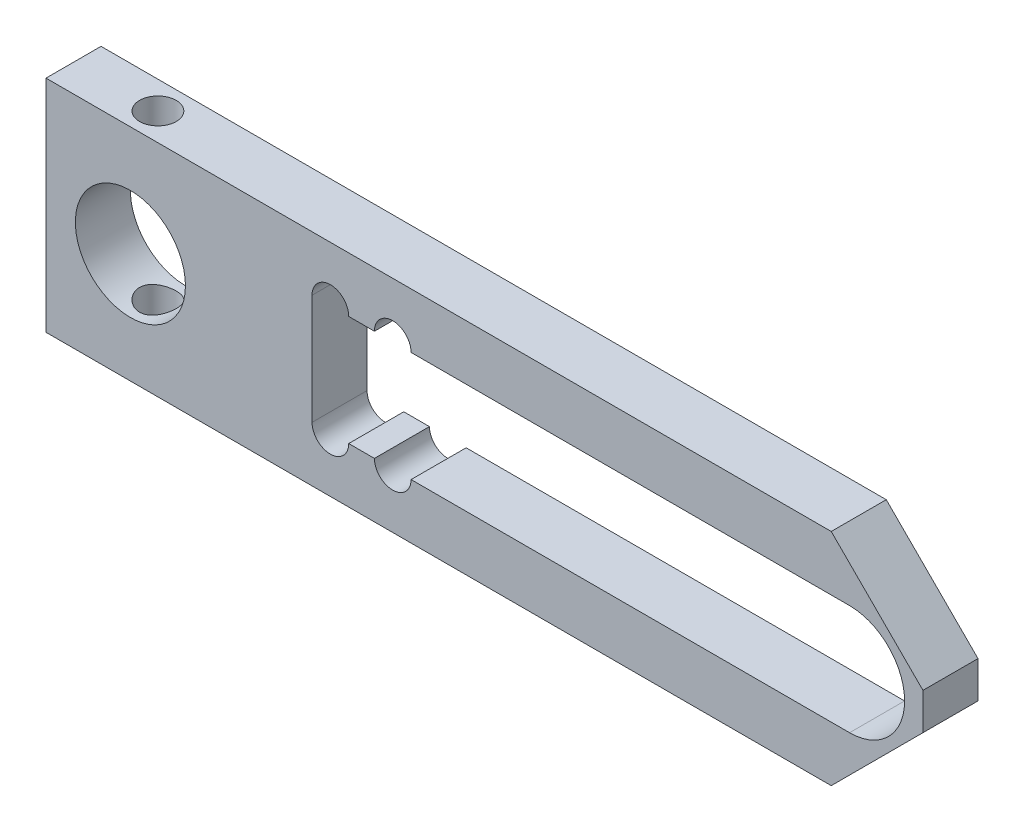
ISO-10303-21;
HEADER;
FILE_DESCRIPTION(('STEP AP214'),'2;1');
FILE_NAME('part.step','',(''),(''),'','','');
FILE_SCHEMA(('AUTOMOTIVE_DESIGN { 1 0 10303 214 1 1 1 1 }'));
ENDSEC;
DATA;
#1=APPLICATION_CONTEXT('core data for automotive mechanical design processes');
#2=APPLICATION_PROTOCOL_DEFINITION('international standard','automotive_design',2000,#1);
#3=PRODUCT_CONTEXT('',#1,'mechanical');
#4=PRODUCT('Part','Part','',(#3));
#5=PRODUCT_RELATED_PRODUCT_CATEGORY('part','',(#4));
#6=PRODUCT_DEFINITION_FORMATION('','',#4);
#7=PRODUCT_DEFINITION_CONTEXT('part definition',#1,'design');
#8=PRODUCT_DEFINITION('design','',#6,#7);
#9=PRODUCT_DEFINITION_SHAPE('','',#8);
#10=(LENGTH_UNIT() NAMED_UNIT(*) SI_UNIT(.MILLI.,.METRE.));
#11=(NAMED_UNIT(*) PLANE_ANGLE_UNIT() SI_UNIT($,.RADIAN.));
#12=(NAMED_UNIT(*) SI_UNIT($,.STERADIAN.) SOLID_ANGLE_UNIT());
#13=UNCERTAINTY_MEASURE_WITH_UNIT(LENGTH_MEASURE(1.E-05),#10,'distance_accuracy_value','');
#14=(GEOMETRIC_REPRESENTATION_CONTEXT(3) GLOBAL_UNCERTAINTY_ASSIGNED_CONTEXT((#13)) GLOBAL_UNIT_ASSIGNED_CONTEXT((#10,
#11,#12)) REPRESENTATION_CONTEXT('',''));
#15=CARTESIAN_POINT('',(0.,0.,0.));
#16=DIRECTION('',(0.,0.,1.));
#17=DIRECTION('',(1.,0.,0.));
#18=AXIS2_PLACEMENT_3D('',#15,#16,#17);
#19=CARTESIAN_POINT('',(71.5,-15.,7.5));
#20=DIRECTION('',(0.,0.,-1.));
#21=DIRECTION('',(-1.,0.,0.));
#22=AXIS2_PLACEMENT_3D('',#19,#20,#21);
#23=CYLINDRICAL_SURFACE('',#22,5.);
#24=CARTESIAN_POINT('',(71.5,-15.,-7.5));
#25=DIRECTION('',(0.,0.,1.));
#26=DIRECTION('',(0.,1.,0.));
#27=AXIS2_PLACEMENT_3D('',#24,#25,#26);
#28=CIRCLE('',#27,5.);
#29=CARTESIAN_POINT('',(66.5,-15.,-7.5));
#30=VERTEX_POINT('',#29);
#31=CARTESIAN_POINT('',(76.5,-15.,-7.5));
#32=VERTEX_POINT('',#31);
#33=EDGE_CURVE('E207',#30,#32,#28,.T.);
#34=ORIENTED_EDGE('',*,*,#33,.F.);
#35=DIRECTION('',(0.,0.,-1.));
#36=VECTOR('',#35,1.);
#37=CARTESIAN_POINT('',(66.5,-15.,7.5));
#38=LINE('',#37,#36);
#39=CARTESIAN_POINT('',(66.5,-15.,7.5));
#40=VERTEX_POINT('',#39);
#41=EDGE_CURVE('E9',#40,#30,#38,.T.);
#42=ORIENTED_EDGE('',*,*,#41,.F.);
#43=CARTESIAN_POINT('',(71.5,-15.,7.5));
#44=DIRECTION('',(0.,0.,1.));
#45=DIRECTION('',(0.,1.,0.));
#46=AXIS2_PLACEMENT_3D('',#43,#44,#45);
#47=CIRCLE('',#46,5.);
#48=CARTESIAN_POINT('',(76.5,-15.,7.5));
#49=VERTEX_POINT('',#48);
#50=EDGE_CURVE('E251',#40,#49,#47,.T.);
#51=ORIENTED_EDGE('',*,*,#50,.T.);
#52=DIRECTION('',(0.,0.,-1.));
#53=VECTOR('',#52,1.);
#54=CARTESIAN_POINT('',(76.5,-15.,7.5));
#55=LINE('',#54,#53);
#56=EDGE_CURVE('E35',#49,#32,#55,.T.);
#57=ORIENTED_EDGE('',*,*,#56,.T.);
#58=EDGE_LOOP('',(#34,#42,#51,#57));
#59=FACE_BOUND('',#58,.T.);
#60=ADVANCED_FACE('F14',(#59),#23,.F.);
#61=CARTESIAN_POINT('',(59.5,-15.,7.5));
#62=DIRECTION('',(0.,1.,0.));
#63=DIRECTION('',(0.,0.,1.));
#64=AXIS2_PLACEMENT_3D('',#61,#62,#63);
#65=PLANE('',#64);
#66=DIRECTION('',(1.,0.,0.));
#67=VECTOR('',#66,1.);
#68=CARTESIAN_POINT('',(59.5,-15.,-7.5));
#69=LINE('',#68,#67);
#70=CARTESIAN_POINT('',(59.5,-15.,-7.5));
#71=VERTEX_POINT('',#70);
#72=EDGE_CURVE('E171',#71,#30,#69,.T.);
#73=ORIENTED_EDGE('',*,*,#72,.F.);
#74=DIRECTION('',(0.,0.,-1.));
#75=VECTOR('',#74,1.);
#76=CARTESIAN_POINT('',(59.5,-15.,7.5));
#77=LINE('',#76,#75);
#78=CARTESIAN_POINT('',(59.5,-15.,7.5));
#79=VERTEX_POINT('',#78);
#80=EDGE_CURVE('E27',#79,#71,#77,.T.);
#81=ORIENTED_EDGE('',*,*,#80,.F.);
#82=DIRECTION('',(1.,0.,0.));
#83=VECTOR('',#82,1.);
#84=CARTESIAN_POINT('',(59.5,-15.,7.5));
#85=LINE('',#84,#83);
#86=EDGE_CURVE('E225',#79,#40,#85,.T.);
#87=ORIENTED_EDGE('',*,*,#86,.T.);
#88=ORIENTED_EDGE('',*,*,#41,.T.);
#89=EDGE_LOOP('',(#73,#81,#87,#88));
#90=FACE_BOUND('',#89,.T.);
#91=ADVANCED_FACE('F310',(#90),#65,.T.);
#92=CARTESIAN_POINT('',(54.5,-15.,7.5));
#93=DIRECTION('',(0.,0.,-1.));
#94=DIRECTION('',(-1.,0.,0.));
#95=AXIS2_PLACEMENT_3D('',#92,#93,#94);
#96=CYLINDRICAL_SURFACE('',#95,5.);
#97=CARTESIAN_POINT('',(54.5,-15.,-7.5));
#98=DIRECTION('',(0.,0.,1.));
#99=DIRECTION('',(-1.,0.,0.));
#100=AXIS2_PLACEMENT_3D('',#97,#98,#99);
#101=CIRCLE('',#100,5.);
#102=CARTESIAN_POINT('',(49.5,-15.,-7.5));
#103=VERTEX_POINT('',#102);
#104=EDGE_CURVE('E175',#103,#71,#101,.T.);
#105=ORIENTED_EDGE('',*,*,#104,.F.);
#106=DIRECTION('',(0.,0.,-1.));
#107=VECTOR('',#106,1.);
#108=CARTESIAN_POINT('',(49.5,-15.,7.5));
#109=LINE('',#108,#107);
#110=CARTESIAN_POINT('',(49.5,-15.,7.5));
#111=VERTEX_POINT('',#110);
#112=EDGE_CURVE('E269',#111,#103,#109,.T.);
#113=ORIENTED_EDGE('',*,*,#112,.F.);
#114=CARTESIAN_POINT('',(54.5,-15.,7.5));
#115=DIRECTION('',(0.,0.,1.));
#116=DIRECTION('',(-1.,0.,0.));
#117=AXIS2_PLACEMENT_3D('',#114,#115,#116);
#118=CIRCLE('',#117,5.);
#119=EDGE_CURVE('E229',#111,#79,#118,.T.);
#120=ORIENTED_EDGE('',*,*,#119,.T.);
#121=ORIENTED_EDGE('',*,*,#80,.T.);
#122=EDGE_LOOP('',(#105,#113,#120,#121));
#123=FACE_BOUND('',#122,.T.);
#124=ADVANCED_FACE('F315',(#123),#96,.F.);
#125=CARTESIAN_POINT('',(49.5,15.,7.5));
#126=DIRECTION('',(1.,0.,0.));
#127=DIRECTION('',(0.,0.,-1.));
#128=AXIS2_PLACEMENT_3D('',#125,#126,#127);
#129=PLANE('',#128);
#130=DIRECTION('',(0.,-1.,0.));
#131=VECTOR('',#130,1.);
#132=CARTESIAN_POINT('',(49.5,15.,-7.5));
#133=LINE('',#132,#131);
#134=CARTESIAN_POINT('',(49.5,15.,-7.5));
#135=VERTEX_POINT('',#134);
#136=EDGE_CURVE('E179',#135,#103,#133,.T.);
#137=ORIENTED_EDGE('',*,*,#136,.F.);
#138=DIRECTION('',(0.,0.,-1.));
#139=VECTOR('',#138,1.);
#140=CARTESIAN_POINT('',(49.5,15.,7.5));
#141=LINE('',#140,#139);
#142=CARTESIAN_POINT('',(49.5,15.,7.5));
#143=VERTEX_POINT('',#142);
#144=EDGE_CURVE('E267',#143,#135,#141,.T.);
#145=ORIENTED_EDGE('',*,*,#144,.F.);
#146=DIRECTION('',(0.,-1.,0.));
#147=VECTOR('',#146,1.);
#148=CARTESIAN_POINT('',(49.5,15.,7.5));
#149=LINE('',#148,#147);
#150=EDGE_CURVE('E232',#143,#111,#149,.T.);
#151=ORIENTED_EDGE('',*,*,#150,.T.);
#152=ORIENTED_EDGE('',*,*,#112,.T.);
#153=EDGE_LOOP('',(#137,#145,#151,#152));
#154=FACE_BOUND('',#153,.T.);
#155=ADVANCED_FACE('F342',(#154),#129,.T.);
#156=CARTESIAN_POINT('',(54.5,15.,7.5));
#157=DIRECTION('',(0.,0.,-1.));
#158=DIRECTION('',(-1.,0.,0.));
#159=AXIS2_PLACEMENT_3D('',#156,#157,#158);
#160=CYLINDRICAL_SURFACE('',#159,5.);
#161=CARTESIAN_POINT('',(54.5,15.,-7.5));
#162=DIRECTION('',(0.,0.,1.));
#163=DIRECTION('',(1.,0.,0.));
#164=AXIS2_PLACEMENT_3D('',#161,#162,#163);
#165=CIRCLE('',#164,5.);
#166=CARTESIAN_POINT('',(59.5,15.,-7.5));
#167=VERTEX_POINT('',#166);
#168=EDGE_CURVE('E183',#167,#135,#165,.T.);
#169=ORIENTED_EDGE('',*,*,#168,.F.);
#170=DIRECTION('',(0.,0.,-1.));
#171=VECTOR('',#170,1.);
#172=CARTESIAN_POINT('',(59.5,15.,7.5));
#173=LINE('',#172,#171);
#174=CARTESIAN_POINT('',(59.5,15.,7.5));
#175=VERTEX_POINT('',#174);
#176=EDGE_CURVE('E265',#175,#167,#173,.T.);
#177=ORIENTED_EDGE('',*,*,#176,.F.);
#178=CARTESIAN_POINT('',(54.5,15.,7.5));
#179=DIRECTION('',(0.,0.,1.));
#180=DIRECTION('',(1.,0.,0.));
#181=AXIS2_PLACEMENT_3D('',#178,#179,#180);
#182=CIRCLE('',#181,5.);
#183=EDGE_CURVE('E235',#175,#143,#182,.T.);
#184=ORIENTED_EDGE('',*,*,#183,.T.);
#185=ORIENTED_EDGE('',*,*,#144,.T.);
#186=EDGE_LOOP('',(#169,#177,#184,#185));
#187=FACE_BOUND('',#186,.T.);
#188=ADVANCED_FACE('F338',(#187),#160,.F.);
#189=CARTESIAN_POINT('',(66.5,15.,7.5));
#190=DIRECTION('',(0.,-1.,0.));
#191=DIRECTION('',(1.,0.,0.));
#192=AXIS2_PLACEMENT_3D('',#189,#190,#191);
#193=PLANE('',#192);
#194=DIRECTION('',(-1.,0.,0.));
#195=VECTOR('',#194,1.);
#196=CARTESIAN_POINT('',(66.5,15.,-7.5));
#197=LINE('',#196,#195);
#198=CARTESIAN_POINT('',(66.5,15.,-7.5));
#199=VERTEX_POINT('',#198);
#200=EDGE_CURVE('E187',#199,#167,#197,.T.);
#201=ORIENTED_EDGE('',*,*,#200,.F.);
#202=DIRECTION('',(0.,0.,-1.));
#203=VECTOR('',#202,1.);
#204=CARTESIAN_POINT('',(66.5,15.,7.5));
#205=LINE('',#204,#203);
#206=CARTESIAN_POINT('',(66.5,15.,7.5));
#207=VERTEX_POINT('',#206);
#208=EDGE_CURVE('E263',#207,#199,#205,.T.);
#209=ORIENTED_EDGE('',*,*,#208,.F.);
#210=DIRECTION('',(-1.,0.,0.));
#211=VECTOR('',#210,1.);
#212=CARTESIAN_POINT('',(66.5,15.,7.5));
#213=LINE('',#212,#211);
#214=EDGE_CURVE('E238',#207,#175,#213,.T.);
#215=ORIENTED_EDGE('',*,*,#214,.T.);
#216=ORIENTED_EDGE('',*,*,#176,.T.);
#217=EDGE_LOOP('',(#201,#209,#215,#216));
#218=FACE_BOUND('',#217,.T.);
#219=ADVANCED_FACE('F334',(#218),#193,.T.);
#220=CARTESIAN_POINT('',(71.5,15.,7.5));
#221=DIRECTION('',(0.,0.,-1.));
#222=DIRECTION('',(-1.,0.,0.));
#223=AXIS2_PLACEMENT_3D('',#220,#221,#222);
#224=CYLINDRICAL_SURFACE('',#223,5.);
#225=CARTESIAN_POINT('',(71.5,15.,-7.5));
#226=DIRECTION('',(0.,0.,1.));
#227=DIRECTION('',(1.,0.,0.));
#228=AXIS2_PLACEMENT_3D('',#225,#226,#227);
#229=CIRCLE('',#228,5.);
#230=CARTESIAN_POINT('',(76.5,15.,-7.5));
#231=VERTEX_POINT('',#230);
#232=EDGE_CURVE('E191',#231,#199,#229,.T.);
#233=ORIENTED_EDGE('',*,*,#232,.F.);
#234=DIRECTION('',(0.,0.,-1.));
#235=VECTOR('',#234,1.);
#236=CARTESIAN_POINT('',(76.5,15.,7.5));
#237=LINE('',#236,#235);
#238=CARTESIAN_POINT('',(76.5,15.,7.5));
#239=VERTEX_POINT('',#238);
#240=EDGE_CURVE('E261',#239,#231,#237,.T.);
#241=ORIENTED_EDGE('',*,*,#240,.F.);
#242=CARTESIAN_POINT('',(71.5,15.,7.5));
#243=DIRECTION('',(0.,0.,1.));
#244=DIRECTION('',(1.,0.,0.));
#245=AXIS2_PLACEMENT_3D('',#242,#243,#244);
#246=CIRCLE('',#245,5.);
#247=EDGE_CURVE('E241',#239,#207,#246,.T.);
#248=ORIENTED_EDGE('',*,*,#247,.T.);
#249=ORIENTED_EDGE('',*,*,#208,.T.);
#250=EDGE_LOOP('',(#233,#241,#248,#249));
#251=FACE_BOUND('',#250,.T.);
#252=ADVANCED_FACE('F330',(#251),#224,.F.);
#253=CARTESIAN_POINT('',(196.,15.,7.5));
#254=DIRECTION('',(0.,-1.,0.));
#255=DIRECTION('',(1.,0.,0.));
#256=AXIS2_PLACEMENT_3D('',#253,#254,#255);
#257=PLANE('',#256);
#258=DIRECTION('',(-1.,0.,0.));
#259=VECTOR('',#258,1.);
#260=CARTESIAN_POINT('',(196.,15.,-7.5));
#261=LINE('',#260,#259);
#262=CARTESIAN_POINT('',(196.,15.,-7.5));
#263=VERTEX_POINT('',#262);
#264=EDGE_CURVE('E195',#263,#231,#261,.T.);
#265=ORIENTED_EDGE('',*,*,#264,.F.);
#266=DIRECTION('',(0.,0.,-1.));
#267=VECTOR('',#266,1.);
#268=CARTESIAN_POINT('',(196.,15.,7.5));
#269=LINE('',#268,#267);
#270=CARTESIAN_POINT('',(196.,15.,7.5));
#271=VERTEX_POINT('',#270);
#272=EDGE_CURVE('E259',#271,#263,#269,.T.);
#273=ORIENTED_EDGE('',*,*,#272,.F.);
#274=DIRECTION('',(-1.,0.,0.));
#275=VECTOR('',#274,1.);
#276=CARTESIAN_POINT('',(196.,15.,7.5));
#277=LINE('',#276,#275);
#278=EDGE_CURVE('E244',#271,#239,#277,.T.);
#279=ORIENTED_EDGE('',*,*,#278,.T.);
#280=ORIENTED_EDGE('',*,*,#240,.T.);
#281=EDGE_LOOP('',(#265,#273,#279,#280));
#282=FACE_BOUND('',#281,.T.);
#283=ADVANCED_FACE('F327',(#282),#257,.T.);
#284=CARTESIAN_POINT('',(196.,0.,7.5));
#285=DIRECTION('',(0.,0.,-1.));
#286=DIRECTION('',(-1.,0.,0.));
#287=AXIS2_PLACEMENT_3D('',#284,#285,#286);
#288=CYLINDRICAL_SURFACE('',#287,15.);
#289=CARTESIAN_POINT('',(196.,0.,-7.5));
#290=DIRECTION('',(0.,0.,1.));
#291=DIRECTION('',(-1.,0.,0.));
#292=AXIS2_PLACEMENT_3D('',#289,#290,#291);
#293=CIRCLE('',#292,15.);
#294=CARTESIAN_POINT('',(196.,-15.,-7.5));
#295=VERTEX_POINT('',#294);
#296=EDGE_CURVE('E199',#295,#263,#293,.T.);
#297=ORIENTED_EDGE('',*,*,#296,.F.);
#298=DIRECTION('',(0.,0.,-1.));
#299=VECTOR('',#298,1.);
#300=CARTESIAN_POINT('',(196.,-15.,7.5));
#301=LINE('',#300,#299);
#302=CARTESIAN_POINT('',(196.,-15.,7.5));
#303=VERTEX_POINT('',#302);
#304=EDGE_CURVE('E43',#303,#295,#301,.T.);
#305=ORIENTED_EDGE('',*,*,#304,.F.);
#306=CARTESIAN_POINT('',(196.,0.,7.5));
#307=DIRECTION('',(0.,0.,1.));
#308=DIRECTION('',(-1.,0.,0.));
#309=AXIS2_PLACEMENT_3D('',#306,#307,#308);
#310=CIRCLE('',#309,15.);
#311=EDGE_CURVE('E247',#303,#271,#310,.T.);
#312=ORIENTED_EDGE('',*,*,#311,.T.);
#313=ORIENTED_EDGE('',*,*,#272,.T.);
#314=EDGE_LOOP('',(#297,#305,#312,#313));
#315=FACE_BOUND('',#314,.T.);
#316=ADVANCED_FACE('F324',(#315),#288,.F.);
#317=CARTESIAN_POINT('',(-23.,30.,7.5));
#318=DIRECTION('',(1.,0.,0.));
#319=DIRECTION('',(0.,1.,0.));
#320=AXIS2_PLACEMENT_3D('',#317,#318,#319);
#321=PLANE('',#320);
#322=DIRECTION('',(0.,-1.,0.));
#323=VECTOR('',#322,1.);
#324=CARTESIAN_POINT('',(-23.,30.,-7.5));
#325=LINE('',#324,#323);
#326=CARTESIAN_POINT('',(-23.,30.,-7.5));
#327=VERTEX_POINT('',#326);
#328=CARTESIAN_POINT('',(-23.,-30.,-7.5));
#329=VERTEX_POINT('',#328);
#330=EDGE_CURVE('E140',#327,#329,#325,.T.);
#331=ORIENTED_EDGE('',*,*,#330,.T.);
#332=DIRECTION('',(0.,0.,-1.));
#333=VECTOR('',#332,1.);
#334=CARTESIAN_POINT('',(-23.,-30.,7.5));
#335=LINE('',#334,#333);
#336=CARTESIAN_POINT('',(-23.,-30.,7.5));
#337=VERTEX_POINT('',#336);
#338=EDGE_CURVE('E149',#337,#329,#335,.T.);
#339=ORIENTED_EDGE('',*,*,#338,.F.);
#340=DIRECTION('',(0.,-1.,0.));
#341=VECTOR('',#340,1.);
#342=CARTESIAN_POINT('',(-23.,30.,7.5));
#343=LINE('',#342,#341);
#344=CARTESIAN_POINT('',(-23.,30.,7.5));
#345=VERTEX_POINT('',#344);
#346=EDGE_CURVE('E215',#345,#337,#343,.T.);
#347=ORIENTED_EDGE('',*,*,#346,.F.);
#348=DIRECTION('',(0.,0.,-1.));
#349=VECTOR('',#348,1.);
#350=CARTESIAN_POINT('',(-23.,30.,7.5));
#351=LINE('',#350,#349);
#352=EDGE_CURVE('E159',#345,#327,#351,.T.);
#353=ORIENTED_EDGE('',*,*,#352,.T.);
#354=EDGE_LOOP('',(#331,#339,#347,#353));
#355=FACE_BOUND('',#354,.T.);
#356=ADVANCED_FACE('F16',(#355),#321,.F.);
#357=CARTESIAN_POINT('',(-23.,-30.,7.5));
#358=DIRECTION('',(0.,1.,0.));
#359=DIRECTION('',(0.,0.,1.));
#360=AXIS2_PLACEMENT_3D('',#357,#358,#359);
#361=PLANE('',#360);
#362=CARTESIAN_POINT('',(0.,-30.,0.));
#363=DIRECTION('',(0.,1.,0.));
#364=DIRECTION('',(0.,0.,-1.));
#365=AXIS2_PLACEMENT_3D('',#362,#363,#364);
#366=CIRCLE('',#365,5.);
#367=CARTESIAN_POINT('',(0.,-30.,-5.));
#368=VERTEX_POINT('',#367);
#369=EDGE_CURVE('E286',#368,#368,#366,.T.);
#370=ORIENTED_EDGE('',*,*,#369,.T.);
#371=EDGE_LOOP('',(#370));
#372=FACE_BOUND('',#371,.T.);
#373=DIRECTION('',(1.,0.,0.));
#374=VECTOR('',#373,1.);
#375=CARTESIAN_POINT('',(-23.,-30.,-7.5));
#376=LINE('',#375,#374);
#377=CARTESIAN_POINT('',(191.,-30.,-7.5));
#378=VERTEX_POINT('',#377);
#379=EDGE_CURVE('E134',#329,#378,#376,.T.);
#380=ORIENTED_EDGE('',*,*,#379,.T.);
#381=DIRECTION('',(0.,0.,-1.));
#382=VECTOR('',#381,1.);
#383=CARTESIAN_POINT('',(191.,-30.,7.5));
#384=LINE('',#383,#382);
#385=CARTESIAN_POINT('',(191.,-30.,7.5));
#386=VERTEX_POINT('',#385);
#387=EDGE_CURVE('E155',#386,#378,#384,.T.);
#388=ORIENTED_EDGE('',*,*,#387,.F.);
#389=DIRECTION('',(1.,0.,0.));
#390=VECTOR('',#389,1.);
#391=CARTESIAN_POINT('',(-23.,-30.,7.5));
#392=LINE('',#391,#390);
#393=EDGE_CURVE('E151',#337,#386,#392,.T.);
#394=ORIENTED_EDGE('',*,*,#393,.F.);
#395=ORIENTED_EDGE('',*,*,#338,.T.);
#396=EDGE_LOOP('',(#380,#388,#394,#395));
#397=FACE_BOUND('',#396,.T.);
#398=ADVANCED_FACE('F150',(#372,#397),#361,.F.);
#399=CARTESIAN_POINT('',(216.,-5.00000000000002,7.5));
#400=DIRECTION('',(-0.707106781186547,0.707106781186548,0.));
#401=DIRECTION('',(-0.707106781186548,-0.707106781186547,0.));
#402=AXIS2_PLACEMENT_3D('',#399,#400,#401);
#403=PLANE('',#402);
#404=DIRECTION('',(0.707106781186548,0.707106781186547,0.));
#405=VECTOR('',#404,1.);
#406=CARTESIAN_POINT('',(216.,-5.00000000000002,-7.5));
#407=LINE('',#406,#405);
#408=CARTESIAN_POINT('',(216.,-5.00000000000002,-7.5));
#409=VERTEX_POINT('',#408);
#410=EDGE_CURVE('E142',#378,#409,#407,.T.);
#411=ORIENTED_EDGE('',*,*,#410,.T.);
#412=DIRECTION('',(0.,0.,-1.));
#413=VECTOR('',#412,1.);
#414=CARTESIAN_POINT('',(216.,-5.00000000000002,7.5));
#415=LINE('',#414,#413);
#416=CARTESIAN_POINT('',(216.,-5.00000000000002,7.5));
#417=VERTEX_POINT('',#416);
#418=EDGE_CURVE('E279',#417,#409,#415,.T.);
#419=ORIENTED_EDGE('',*,*,#418,.F.);
#420=DIRECTION('',(0.707106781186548,0.707106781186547,0.));
#421=VECTOR('',#420,1.);
#422=CARTESIAN_POINT('',(216.,-5.00000000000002,7.5));
#423=LINE('',#422,#421);
#424=EDGE_CURVE('E217',#386,#417,#423,.T.);
#425=ORIENTED_EDGE('',*,*,#424,.F.);
#426=ORIENTED_EDGE('',*,*,#387,.T.);
#427=EDGE_LOOP('',(#411,#419,#425,#426));
#428=FACE_BOUND('',#427,.T.);
#429=ADVANCED_FACE('F359',(#428),#403,.F.);
#430=CARTESIAN_POINT('',(216.,-5.00000000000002,7.5));
#431=DIRECTION('',(-1.,0.,0.));
#432=DIRECTION('',(0.,0.,1.));
#433=AXIS2_PLACEMENT_3D('',#430,#431,#432);
#434=PLANE('',#433);
#435=DIRECTION('',(0.,1.,0.));
#436=VECTOR('',#435,1.);
#437=CARTESIAN_POINT('',(216.,-5.00000000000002,-7.5));
#438=LINE('',#437,#436);
#439=CARTESIAN_POINT('',(216.,5.,-7.5));
#440=VERTEX_POINT('',#439);
#441=EDGE_CURVE('E375',#409,#440,#438,.T.);
#442=ORIENTED_EDGE('',*,*,#441,.T.);
#443=DIRECTION('',(0.,0.,-1.));
#444=VECTOR('',#443,1.);
#445=CARTESIAN_POINT('',(216.,5.,7.5));
#446=LINE('',#445,#444);
#447=CARTESIAN_POINT('',(216.,5.,7.5));
#448=VERTEX_POINT('',#447);
#449=EDGE_CURVE('E276',#448,#440,#446,.T.);
#450=ORIENTED_EDGE('',*,*,#449,.F.);
#451=DIRECTION('',(0.,1.,0.));
#452=VECTOR('',#451,1.);
#453=CARTESIAN_POINT('',(216.,-5.00000000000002,7.5));
#454=LINE('',#453,#452);
#455=EDGE_CURVE('E219',#417,#448,#454,.T.);
#456=ORIENTED_EDGE('',*,*,#455,.F.);
#457=ORIENTED_EDGE('',*,*,#418,.T.);
#458=EDGE_LOOP('',(#442,#450,#456,#457));
#459=FACE_BOUND('',#458,.T.);
#460=ADVANCED_FACE('F355',(#459),#434,.F.);
#461=CARTESIAN_POINT('',(191.,30.,7.5));
#462=DIRECTION('',(-0.707106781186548,-0.707106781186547,0.));
#463=DIRECTION('',(0.707106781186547,-0.707106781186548,0.));
#464=AXIS2_PLACEMENT_3D('',#461,#462,#463);
#465=PLANE('',#464);
#466=DIRECTION('',(-0.707106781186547,0.707106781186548,0.));
#467=VECTOR('',#466,1.);
#468=CARTESIAN_POINT('',(191.,30.,-7.5));
#469=LINE('',#468,#467);
#470=CARTESIAN_POINT('',(191.,30.,-7.5));
#471=VERTEX_POINT('',#470);
#472=EDGE_CURVE('E377',#440,#471,#469,.T.);
#473=ORIENTED_EDGE('',*,*,#472,.T.);
#474=DIRECTION('',(0.,0.,-1.));
#475=VECTOR('',#474,1.);
#476=CARTESIAN_POINT('',(191.,30.,7.5));
#477=LINE('',#476,#475);
#478=CARTESIAN_POINT('',(191.,30.,7.5));
#479=VERTEX_POINT('',#478);
#480=EDGE_CURVE('E273',#479,#471,#477,.T.);
#481=ORIENTED_EDGE('',*,*,#480,.F.);
#482=DIRECTION('',(-0.707106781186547,0.707106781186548,0.));
#483=VECTOR('',#482,1.);
#484=CARTESIAN_POINT('',(191.,30.,7.5));
#485=LINE('',#484,#483);
#486=EDGE_CURVE('E221',#448,#479,#485,.T.);
#487=ORIENTED_EDGE('',*,*,#486,.F.);
#488=ORIENTED_EDGE('',*,*,#449,.T.);
#489=EDGE_LOOP('',(#473,#481,#487,#488));
#490=FACE_BOUND('',#489,.T.);
#491=ADVANCED_FACE('F323',(#490),#465,.F.);
#492=CARTESIAN_POINT('',(76.5,-15.,7.5));
#493=DIRECTION('',(0.,1.,0.));
#494=DIRECTION('',(-1.,0.,0.));
#495=AXIS2_PLACEMENT_3D('',#492,#493,#494);
#496=PLANE('',#495);
#497=DIRECTION('',(1.,0.,0.));
#498=VECTOR('',#497,1.);
#499=CARTESIAN_POINT('',(76.5,-15.,-7.5));
#500=LINE('',#499,#498);
#501=EDGE_CURVE('E203',#32,#295,#500,.T.);
#502=ORIENTED_EDGE('',*,*,#501,.F.);
#503=ORIENTED_EDGE('',*,*,#56,.F.);
#504=DIRECTION('',(1.,0.,0.));
#505=VECTOR('',#504,1.);
#506=CARTESIAN_POINT('',(76.5,-15.,7.5));
#507=LINE('',#506,#505);
#508=EDGE_CURVE('E249',#49,#303,#507,.T.);
#509=ORIENTED_EDGE('',*,*,#508,.T.);
#510=ORIENTED_EDGE('',*,*,#304,.T.);
#511=EDGE_LOOP('',(#502,#503,#509,#510));
#512=FACE_BOUND('',#511,.T.);
#513=ADVANCED_FACE('F320',(#512),#496,.T.);
#514=CARTESIAN_POINT('',(191.,30.,7.5));
#515=DIRECTION('',(0.,-1.,0.));
#516=DIRECTION('',(0.,0.,-1.));
#517=AXIS2_PLACEMENT_3D('',#514,#515,#516);
#518=PLANE('',#517);
#519=CARTESIAN_POINT('',(0.,30.,0.));
#520=DIRECTION('',(0.,-1.,0.));
#521=DIRECTION('',(0.,0.,-1.));
#522=AXIS2_PLACEMENT_3D('',#519,#520,#521);
#523=CIRCLE('',#522,5.);
#524=CARTESIAN_POINT('',(0.,30.,-5.));
#525=VERTEX_POINT('',#524);
#526=EDGE_CURVE('E161',#525,#525,#523,.T.);
#527=ORIENTED_EDGE('',*,*,#526,.T.);
#528=EDGE_LOOP('',(#527));
#529=FACE_BOUND('',#528,.T.);
#530=DIRECTION('',(-1.,0.,0.));
#531=VECTOR('',#530,1.);
#532=CARTESIAN_POINT('',(191.,30.,-7.5));
#533=LINE('',#532,#531);
#534=EDGE_CURVE('E169',#471,#327,#533,.T.);
#535=ORIENTED_EDGE('',*,*,#534,.T.);
#536=ORIENTED_EDGE('',*,*,#352,.F.);
#537=DIRECTION('',(-1.,0.,0.));
#538=VECTOR('',#537,1.);
#539=CARTESIAN_POINT('',(191.,30.,7.5));
#540=LINE('',#539,#538);
#541=EDGE_CURVE('E223',#479,#345,#540,.T.);
#542=ORIENTED_EDGE('',*,*,#541,.F.);
#543=ORIENTED_EDGE('',*,*,#480,.T.);
#544=EDGE_LOOP('',(#535,#536,#542,#543));
#545=FACE_BOUND('',#544,.T.);
#546=ADVANCED_FACE('F306',(#529,#545),#518,.F.);
#547=CARTESIAN_POINT('',(0.,0.,7.5));
#548=DIRECTION('',(0.,0.,-1.));
#549=DIRECTION('',(-1.,0.,0.));
#550=AXIS2_PLACEMENT_3D('',#547,#548,#549);
#551=CYLINDRICAL_SURFACE('',#550,15.);
#552=CARTESIAN_POINT('',(0.,-15.,-5.));
#553=CARTESIAN_POINT('',(0.272816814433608,-15.0000007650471,-5.00000126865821));
#554=CARTESIAN_POINT('',(0.54562597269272,-14.9924884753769,-4.97759866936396));
#555=CARTESIAN_POINT('',(1.08320880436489,-14.9632605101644,-4.88885445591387));
#556=CARTESIAN_POINT('',(1.3479816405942,-14.941543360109,-4.82250828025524));
#557=CARTESIAN_POINT('',(1.86166394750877,-14.8862653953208,-4.64840378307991));
#558=CARTESIAN_POINT('',(2.11059912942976,-14.8527243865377,-4.5407146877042));
#559=CARTESIAN_POINT('',(2.58687468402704,-14.7772222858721,-4.2872941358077));
#560=CARTESIAN_POINT('',(2.81421078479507,-14.7352595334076,-4.1415551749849));
#561=CARTESIAN_POINT('',(3.24870837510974,-14.6457047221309,-3.8108709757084));
#562=CARTESIAN_POINT('',(3.45501850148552,-14.5979778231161,-3.62484382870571));
#563=CARTESIAN_POINT('',(3.83416346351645,-14.5030157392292,-3.22116422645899));
#564=CARTESIAN_POINT('',(4.00699092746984,-14.4557806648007,-3.00350482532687));
#565=CARTESIAN_POINT('',(4.31912471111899,-14.3656666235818,-2.53507442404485));
#566=CARTESIAN_POINT('',(4.45732429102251,-14.3229519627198,-2.28353130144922));
#567=CARTESIAN_POINT('',(4.68909436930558,-14.2487652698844,-1.75911952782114));
#568=CARTESIAN_POINT('',(4.78267848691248,-14.2172898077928,-1.48625741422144));
#569=CARTESIAN_POINT('',(4.91936730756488,-14.1705651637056,-0.936633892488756));
#570=CARTESIAN_POINT('',(4.96406724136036,-14.1548047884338,-0.660313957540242));
#571=CARTESIAN_POINT('',(5.00670561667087,-14.1397828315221,-0.103681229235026));
#572=CARTESIAN_POINT('',(5.00465850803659,-14.1405161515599,0.176630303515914));
#573=CARTESIAN_POINT('',(4.95509951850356,-14.1579507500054,0.719683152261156));
#574=CARTESIAN_POINT('',(4.90966956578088,-14.1739207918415,0.982642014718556));
#575=CARTESIAN_POINT('',(4.77803081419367,-14.2188328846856,1.49696709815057));
#576=CARTESIAN_POINT('',(4.69181713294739,-14.2477764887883,1.74833192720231));
#577=CARTESIAN_POINT('',(4.47969529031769,-14.3158955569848,2.2370637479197));
#578=CARTESIAN_POINT('',(4.35317024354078,-14.3552282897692,2.47414012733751));
#579=CARTESIAN_POINT('',(4.06444553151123,-14.4396279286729,2.92435454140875));
#580=CARTESIAN_POINT('',(3.9022355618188,-14.4846964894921,3.13748563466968));
#581=CARTESIAN_POINT('',(3.53674666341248,-14.5783664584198,3.54545799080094));
#582=CARTESIAN_POINT('',(3.3317657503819,-14.6270294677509,3.73876347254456));
#583=CARTESIAN_POINT('',(2.89169784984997,-14.7203469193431,4.08865633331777));
#584=CARTESIAN_POINT('',(2.65660797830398,-14.765000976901,4.24524019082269));
#585=CARTESIAN_POINT('',(2.15973806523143,-14.8458553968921,4.51848150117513));
#586=CARTESIAN_POINT('',(1.89771638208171,-14.8819675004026,4.6347274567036));
#587=CARTESIAN_POINT('',(1.35634541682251,-14.9410283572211,4.82101586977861));
#588=CARTESIAN_POINT('',(1.07700219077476,-14.9639816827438,4.8910743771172));
#589=CARTESIAN_POINT('',(0.521919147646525,-14.9933813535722,4.98027833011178));
#590=CARTESIAN_POINT('',(0.246547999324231,-15.0005000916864,5.00149904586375));
#591=CARTESIAN_POINT('',(-0.30387534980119,-14.9994451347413,4.99833663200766));
#592=CARTESIAN_POINT('',(-0.578927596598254,-14.9912740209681,4.97396120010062));
#593=CARTESIAN_POINT('',(-1.11259933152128,-14.9610012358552,4.8819404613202));
#594=CARTESIAN_POINT('',(-1.37146403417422,-14.9393099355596,4.81556896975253));
#595=CARTESIAN_POINT('',(-1.87427979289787,-14.8845923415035,4.64303277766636));
#596=CARTESIAN_POINT('',(-2.11822894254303,-14.8515646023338,4.53686300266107));
#597=CARTESIAN_POINT('',(-2.59144148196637,-14.7764465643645,4.28464784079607));
#598=CARTESIAN_POINT('',(-2.82014979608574,-14.7341407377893,4.13762703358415));
#599=CARTESIAN_POINT('',(-3.25032415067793,-14.6452626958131,3.80902924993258));
#600=CARTESIAN_POINT('',(-3.45178183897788,-14.5986891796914,3.62744171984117));
#601=CARTESIAN_POINT('',(-3.8312625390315,-14.5038423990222,3.22510624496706));
#602=CARTESIAN_POINT('',(-4.00780484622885,-14.4555880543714,3.0029538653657));
#603=CARTESIAN_POINT('',(-4.32128761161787,-14.3649986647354,2.53114216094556));
#604=CARTESIAN_POINT('',(-4.45822773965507,-14.3226636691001,2.28148260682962));
#605=CARTESIAN_POINT('',(-4.68798465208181,-14.2491195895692,1.76163492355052));
#606=CARTESIAN_POINT('',(-4.7808906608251,-14.2178880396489,1.49148960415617));
#607=CARTESIAN_POINT('',(-4.91947333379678,-14.1705416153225,0.938106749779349));
#608=CARTESIAN_POINT('',(-4.9651712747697,-14.154419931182,0.654875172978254));
#609=CARTESIAN_POINT('',(-5.00638141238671,-14.1398929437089,0.0990145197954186));
#610=CARTESIAN_POINT('',(-5.004351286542,-14.1406200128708,-0.173411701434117));
#611=CARTESIAN_POINT('',(-4.95621146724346,-14.1575634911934,-0.713825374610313));
#612=CARTESIAN_POINT('',(-4.91010439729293,-14.1737789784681,-0.981813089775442));
#613=CARTESIAN_POINT('',(-4.77685906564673,-14.2192262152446,-1.50067831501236));
#614=CARTESIAN_POINT('',(-4.69051673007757,-14.2482049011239,-1.75178412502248));
#615=CARTESIAN_POINT('',(-4.47989682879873,-14.3158199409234,-2.23613703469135));
#616=CARTESIAN_POINT('',(-4.35561084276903,-14.3544584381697,-2.46938015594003));
#617=CARTESIAN_POINT('',(-4.06630346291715,-14.4391414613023,-2.92241834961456));
#618=CARTESIAN_POINT('',(-3.8997412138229,-14.4854355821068,-3.14118250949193));
#619=CARTESIAN_POINT('',(-3.53321441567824,-14.5791678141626,-3.548449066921));
#620=CARTESIAN_POINT('',(-3.33324042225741,-14.6266062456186,-3.73694287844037));
#621=CARTESIAN_POINT('',(-2.89620778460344,-14.7195015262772,-4.08572206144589));
#622=CARTESIAN_POINT('',(-2.65800756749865,-14.7648090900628,-4.244621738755));
#623=CARTESIAN_POINT('',(-2.15678678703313,-14.8462995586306,-4.51995214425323));
#624=CARTESIAN_POINT('',(-1.89377259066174,-14.8824847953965,-4.63639372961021));
#625=CARTESIAN_POINT('',(-1.36246823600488,-14.9402757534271,-4.81860816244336));
#626=CARTESIAN_POINT('',(-1.09493878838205,-14.9624606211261,-4.88641233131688));
#627=CARTESIAN_POINT('',(-0.551602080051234,-14.9923203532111,-4.97710140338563));
#628=CARTESIAN_POINT('',(-0.275797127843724,-14.9999992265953,-4.99999871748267));
#629=CARTESIAN_POINT('',(0.,-15.,-5.));
#630=B_SPLINE_CURVE_WITH_KNOTS('',3,(#552,#553,#554,#555,#556,#557,#558,#559,#560,#561,#562,
#563,#564,#565,#566,#567,#568,#569,#570,#571,#572,#573,#574,#575,#576,#577,#578,#579,#580,#581,
#582,#583,#584,#585,#586,#587,#588,#589,#590,#591,#592,#593,#594,#595,#596,#597,#598,#599,#600,
#601,#602,#603,#604,#605,#606,#607,#608,#609,#610,#611,#612,#613,#614,#615,#616,#617,#618,#619,
#620,#621,#622,#623,#624,#625,#626,#627,#628,#629),.UNSPECIFIED.,.T.,.F.,(4,2,2,2,2,2,2,2,2,2,2,
2,2,2,2,2,2,2,2,2,2,2,2,2,2,2,2,2,2,2,2,2,2,2,2,2,2,2,4),(0.,0.817435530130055,1.6349559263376,
2.45111336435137,3.2674318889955,4.1092342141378,4.95122166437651,5.81741924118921,
6.6833522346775,7.52009628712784,8.3565816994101,9.15484132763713,9.95319654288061,
10.764408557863,11.5758551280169,12.4296652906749,13.2835572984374,14.1459202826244,
15.0079834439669,15.832679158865,16.6572356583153,17.4579078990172,18.2586822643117,
19.0805199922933,19.9026090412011,20.7620511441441,21.6215004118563,22.479200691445,
23.3365142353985,24.1497833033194,24.9630039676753,25.7607793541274,26.5587319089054,
27.3915033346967,28.2245105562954,29.0899830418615,29.9552340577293,30.7818279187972,
31.6081933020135),.UNSPECIFIED.);
#631=CARTESIAN_POINT('',(0.,-15.,-5.));
#632=VERTEX_POINT('',#631);
#633=EDGE_CURVE('E18',#632,#632,#630,.T.);
#634=ORIENTED_EDGE('',*,*,#633,.T.);
#635=EDGE_LOOP('',(#634));
#636=FACE_BOUND('',#635,.T.);
#637=CARTESIAN_POINT('',(0.,15.,-5.));
#638=CARTESIAN_POINT('',(-0.272816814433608,15.0000007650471,-5.00000126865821));
#639=CARTESIAN_POINT('',(-0.54562597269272,14.9924884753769,-4.97759866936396));
#640=CARTESIAN_POINT('',(-1.08320880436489,14.9632605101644,-4.88885445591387));
#641=CARTESIAN_POINT('',(-1.3479816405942,14.941543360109,-4.82250828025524));
#642=CARTESIAN_POINT('',(-1.86166394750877,14.8862653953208,-4.64840378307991));
#643=CARTESIAN_POINT('',(-2.11059912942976,14.8527243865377,-4.5407146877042));
#644=CARTESIAN_POINT('',(-2.58687468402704,14.7772222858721,-4.2872941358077));
#645=CARTESIAN_POINT('',(-2.81421078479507,14.7352595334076,-4.1415551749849));
#646=CARTESIAN_POINT('',(-3.24870837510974,14.6457047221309,-3.8108709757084));
#647=CARTESIAN_POINT('',(-3.45501850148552,14.5979778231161,-3.62484382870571));
#648=CARTESIAN_POINT('',(-3.83416346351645,14.5030157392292,-3.22116422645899));
#649=CARTESIAN_POINT('',(-4.00699092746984,14.4557806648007,-3.00350482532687));
#650=CARTESIAN_POINT('',(-4.31912471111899,14.3656666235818,-2.53507442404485));
#651=CARTESIAN_POINT('',(-4.45732429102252,14.3229519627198,-2.28353130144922));
#652=CARTESIAN_POINT('',(-4.68909436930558,14.2487652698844,-1.75911952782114));
#653=CARTESIAN_POINT('',(-4.78267848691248,14.2172898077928,-1.48625741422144));
#654=CARTESIAN_POINT('',(-4.91936730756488,14.1705651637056,-0.936633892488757));
#655=CARTESIAN_POINT('',(-4.96406724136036,14.1548047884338,-0.660313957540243));
#656=CARTESIAN_POINT('',(-5.00670561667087,14.1397828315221,-0.103681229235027));
#657=CARTESIAN_POINT('',(-5.00465850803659,14.1405161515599,0.176630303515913));
#658=CARTESIAN_POINT('',(-4.95509951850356,14.1579507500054,0.719683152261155));
#659=CARTESIAN_POINT('',(-4.90966956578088,14.1739207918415,0.982642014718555));
#660=CARTESIAN_POINT('',(-4.77803081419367,14.2188328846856,1.49696709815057));
#661=CARTESIAN_POINT('',(-4.69181713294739,14.2477764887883,1.74833192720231));
#662=CARTESIAN_POINT('',(-4.47969529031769,14.3158955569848,2.23706374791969));
#663=CARTESIAN_POINT('',(-4.35317024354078,14.3552282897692,2.47414012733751));
#664=CARTESIAN_POINT('',(-4.06444553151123,14.4396279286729,2.92435454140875));
#665=CARTESIAN_POINT('',(-3.9022355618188,14.4846964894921,3.13748563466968));
#666=CARTESIAN_POINT('',(-3.53674666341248,14.5783664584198,3.54545799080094));
#667=CARTESIAN_POINT('',(-3.3317657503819,14.6270294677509,3.73876347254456));
#668=CARTESIAN_POINT('',(-2.89169784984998,14.7203469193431,4.08865633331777));
#669=CARTESIAN_POINT('',(-2.65660797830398,14.765000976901,4.24524019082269));
#670=CARTESIAN_POINT('',(-2.15973806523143,14.8458553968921,4.51848150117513));
#671=CARTESIAN_POINT('',(-1.89771638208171,14.8819675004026,4.6347274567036));
#672=CARTESIAN_POINT('',(-1.35634541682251,14.9410283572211,4.82101586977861));
#673=CARTESIAN_POINT('',(-1.07700219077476,14.9639816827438,4.8910743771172));
#674=CARTESIAN_POINT('',(-0.521919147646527,14.9933813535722,4.98027833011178));
#675=CARTESIAN_POINT('',(-0.246547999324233,15.0005000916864,5.00149904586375));
#676=CARTESIAN_POINT('',(0.303875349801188,14.9994451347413,4.99833663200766));
#677=CARTESIAN_POINT('',(0.578927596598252,14.9912740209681,4.97396120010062));
#678=CARTESIAN_POINT('',(1.11259933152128,14.9610012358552,4.88194046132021));
#679=CARTESIAN_POINT('',(1.37146403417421,14.9393099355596,4.81556896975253));
#680=CARTESIAN_POINT('',(1.87427979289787,14.8845923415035,4.64303277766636));
#681=CARTESIAN_POINT('',(2.11822894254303,14.8515646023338,4.53686300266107));
#682=CARTESIAN_POINT('',(2.59144148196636,14.7764465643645,4.28464784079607));
#683=CARTESIAN_POINT('',(2.82014979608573,14.7341407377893,4.13762703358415));
#684=CARTESIAN_POINT('',(3.25032415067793,14.6452626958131,3.80902924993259));
#685=CARTESIAN_POINT('',(3.45178183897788,14.5986891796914,3.62744171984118));
#686=CARTESIAN_POINT('',(3.8312625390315,14.5038423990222,3.22510624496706));
#687=CARTESIAN_POINT('',(4.00780484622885,14.4555880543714,3.0029538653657));
#688=CARTESIAN_POINT('',(4.32128761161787,14.3649986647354,2.53114216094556));
#689=CARTESIAN_POINT('',(4.45822773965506,14.3226636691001,2.28148260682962));
#690=CARTESIAN_POINT('',(4.68798465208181,14.2491195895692,1.76163492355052));
#691=CARTESIAN_POINT('',(4.7808906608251,14.2178880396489,1.49148960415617));
#692=CARTESIAN_POINT('',(4.91947333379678,14.1705416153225,0.938106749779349));
#693=CARTESIAN_POINT('',(4.9651712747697,14.154419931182,0.654875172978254));
#694=CARTESIAN_POINT('',(5.00638141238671,14.1398929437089,0.0990145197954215));
#695=CARTESIAN_POINT('',(5.004351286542,14.1406200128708,-0.173411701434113));
#696=CARTESIAN_POINT('',(4.95621146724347,14.1575634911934,-0.713825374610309));
#697=CARTESIAN_POINT('',(4.91010439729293,14.1737789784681,-0.981813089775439));
#698=CARTESIAN_POINT('',(4.77685906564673,14.2192262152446,-1.50067831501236));
#699=CARTESIAN_POINT('',(4.69051673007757,14.2482049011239,-1.75178412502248));
#700=CARTESIAN_POINT('',(4.47989682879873,14.3158199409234,-2.23613703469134));
#701=CARTESIAN_POINT('',(4.35561084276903,14.3544584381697,-2.46938015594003));
#702=CARTESIAN_POINT('',(4.06630346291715,14.4391414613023,-2.92241834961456));
#703=CARTESIAN_POINT('',(3.8997412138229,14.4854355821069,-3.14118250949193));
#704=CARTESIAN_POINT('',(3.53321441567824,14.5791678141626,-3.548449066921));
#705=CARTESIAN_POINT('',(3.33324042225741,14.6266062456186,-3.73694287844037));
#706=CARTESIAN_POINT('',(2.89620778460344,14.7195015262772,-4.08572206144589));
#707=CARTESIAN_POINT('',(2.65800756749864,14.7648090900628,-4.244621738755));
#708=CARTESIAN_POINT('',(2.15678678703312,14.8462995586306,-4.51995214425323));
#709=CARTESIAN_POINT('',(1.89377259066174,14.8824847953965,-4.63639372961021));
#710=CARTESIAN_POINT('',(1.36246823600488,14.9402757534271,-4.81860816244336));
#711=CARTESIAN_POINT('',(1.09493878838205,14.9624606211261,-4.88641233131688));
#712=CARTESIAN_POINT('',(0.551602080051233,14.9923203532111,-4.97710140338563));
#713=CARTESIAN_POINT('',(0.275797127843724,14.9999992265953,-4.99999871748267));
#714=CARTESIAN_POINT('',(0.,15.,-5.));
#715=B_SPLINE_CURVE_WITH_KNOTS('',3,(#637,#638,#639,#640,#641,#642,#643,#644,#645,#646,#647,
#648,#649,#650,#651,#652,#653,#654,#655,#656,#657,#658,#659,#660,#661,#662,#663,#664,#665,#666,
#667,#668,#669,#670,#671,#672,#673,#674,#675,#676,#677,#678,#679,#680,#681,#682,#683,#684,#685,
#686,#687,#688,#689,#690,#691,#692,#693,#694,#695,#696,#697,#698,#699,#700,#701,#702,#703,#704,
#705,#706,#707,#708,#709,#710,#711,#712,#713,#714),.UNSPECIFIED.,.T.,.F.,(4,2,2,2,2,2,2,2,2,2,2,
2,2,2,2,2,2,2,2,2,2,2,2,2,2,2,2,2,2,2,2,2,2,2,2,2,2,2,4),(0.,0.817435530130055,1.6349559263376,
2.45111336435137,3.2674318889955,4.1092342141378,4.95122166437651,5.81741924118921,
6.6833522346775,7.52009628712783,8.3565816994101,9.15484132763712,9.9531965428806,
10.764408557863,11.5758551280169,12.4296652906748,13.2835572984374,14.1459202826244,
15.0079834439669,15.832679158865,16.6572356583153,17.4579078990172,18.2586822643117,
19.0805199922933,19.9026090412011,20.7620511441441,21.6215004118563,22.479200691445,
23.3365142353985,24.1497833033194,24.9630039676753,25.7607793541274,26.5587319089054,
27.3915033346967,28.2245105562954,29.0899830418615,29.9552340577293,30.7818279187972,
31.6081933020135),.UNSPECIFIED.);
#716=CARTESIAN_POINT('',(0.,15.,-5.));
#717=VERTEX_POINT('',#716);
#718=EDGE_CURVE('E282',#717,#717,#715,.T.);
#719=ORIENTED_EDGE('',*,*,#718,.T.);
#720=EDGE_LOOP('',(#719));
#721=FACE_BOUND('',#720,.T.);
#722=CARTESIAN_POINT('',(0.,0.,7.5));
#723=DIRECTION('',(0.,0.,-1.));
#724=DIRECTION('',(1.,0.,0.));
#725=AXIS2_PLACEMENT_3D('',#722,#723,#724);
#726=CIRCLE('',#725,15.);
#727=CARTESIAN_POINT('',(15.,0.,7.5));
#728=VERTEX_POINT('',#727);
#729=EDGE_CURVE('E254',#728,#728,#726,.T.);
#730=ORIENTED_EDGE('',*,*,#729,.F.);
#731=EDGE_LOOP('',(#730));
#732=FACE_BOUND('',#731,.T.);
#733=CARTESIAN_POINT('',(0.,0.,-7.5));
#734=DIRECTION('',(0.,0.,-1.));
#735=DIRECTION('',(1.,0.,0.));
#736=AXIS2_PLACEMENT_3D('',#733,#734,#735);
#737=CIRCLE('',#736,15.);
#738=CARTESIAN_POINT('',(15.,0.,-7.5));
#739=VERTEX_POINT('',#738);
#740=EDGE_CURVE('E211',#739,#739,#737,.T.);
#741=ORIENTED_EDGE('',*,*,#740,.T.);
#742=EDGE_LOOP('',(#741));
#743=FACE_BOUND('',#742,.T.);
#744=ADVANCED_FACE('F287',(#636,#721,#732,#743),#551,.F.);
#745=CARTESIAN_POINT('',(-23.,-30.,7.5));
#746=DIRECTION('',(0.,0.,1.));
#747=DIRECTION('',(1.,0.,0.));
#748=AXIS2_PLACEMENT_3D('',#745,#746,#747);
#749=PLANE('',#748);
#750=ORIENTED_EDGE('',*,*,#346,.T.);
#751=ORIENTED_EDGE('',*,*,#393,.T.);
#752=ORIENTED_EDGE('',*,*,#424,.T.);
#753=ORIENTED_EDGE('',*,*,#455,.T.);
#754=ORIENTED_EDGE('',*,*,#486,.T.);
#755=ORIENTED_EDGE('',*,*,#541,.T.);
#756=EDGE_LOOP('',(#750,#751,#752,#753,#754,#755));
#757=FACE_BOUND('',#756,.T.);
#758=ORIENTED_EDGE('',*,*,#50,.F.);
#759=ORIENTED_EDGE('',*,*,#86,.F.);
#760=ORIENTED_EDGE('',*,*,#119,.F.);
#761=ORIENTED_EDGE('',*,*,#150,.F.);
#762=ORIENTED_EDGE('',*,*,#183,.F.);
#763=ORIENTED_EDGE('',*,*,#214,.F.);
#764=ORIENTED_EDGE('',*,*,#247,.F.);
#765=ORIENTED_EDGE('',*,*,#278,.F.);
#766=ORIENTED_EDGE('',*,*,#311,.F.);
#767=ORIENTED_EDGE('',*,*,#508,.F.);
#768=EDGE_LOOP('',(#758,#759,#760,#761,#762,#763,#764,#765,#766,#767));
#769=FACE_BOUND('',#768,.T.);
#770=ORIENTED_EDGE('',*,*,#729,.T.);
#771=EDGE_LOOP('',(#770));
#772=FACE_BOUND('',#771,.T.);
#773=ADVANCED_FACE('F299',(#757,#769,#772),#749,.T.);
#774=CARTESIAN_POINT('',(-23.,-30.,-7.5));
#775=DIRECTION('',(0.,0.,1.));
#776=DIRECTION('',(1.,0.,0.));
#777=AXIS2_PLACEMENT_3D('',#774,#775,#776);
#778=PLANE('',#777);
#779=ORIENTED_EDGE('',*,*,#330,.F.);
#780=ORIENTED_EDGE('',*,*,#534,.F.);
#781=ORIENTED_EDGE('',*,*,#472,.F.);
#782=ORIENTED_EDGE('',*,*,#441,.F.);
#783=ORIENTED_EDGE('',*,*,#410,.F.);
#784=ORIENTED_EDGE('',*,*,#379,.F.);
#785=EDGE_LOOP('',(#779,#780,#781,#782,#783,#784));
#786=FACE_BOUND('',#785,.T.);
#787=ORIENTED_EDGE('',*,*,#33,.T.);
#788=ORIENTED_EDGE('',*,*,#501,.T.);
#789=ORIENTED_EDGE('',*,*,#296,.T.);
#790=ORIENTED_EDGE('',*,*,#264,.T.);
#791=ORIENTED_EDGE('',*,*,#232,.T.);
#792=ORIENTED_EDGE('',*,*,#200,.T.);
#793=ORIENTED_EDGE('',*,*,#168,.T.);
#794=ORIENTED_EDGE('',*,*,#136,.T.);
#795=ORIENTED_EDGE('',*,*,#104,.T.);
#796=ORIENTED_EDGE('',*,*,#72,.T.);
#797=EDGE_LOOP('',(#787,#788,#789,#790,#791,#792,#793,#794,#795,#796));
#798=FACE_BOUND('',#797,.T.);
#799=ORIENTED_EDGE('',*,*,#740,.F.);
#800=EDGE_LOOP('',(#799));
#801=FACE_BOUND('',#800,.T.);
#802=ADVANCED_FACE('F136',(#786,#798,#801),#778,.F.);
#803=CARTESIAN_POINT('',(0.,-30.,0.));
#804=DIRECTION('',(0.,1.,0.));
#805=DIRECTION('',(0.,0.,-1.));
#806=AXIS2_PLACEMENT_3D('',#803,#804,#805);
#807=CYLINDRICAL_SURFACE('',#806,5.);
#808=ORIENTED_EDGE('',*,*,#718,.F.);
#809=EDGE_LOOP('',(#808));
#810=FACE_BOUND('',#809,.T.);
#811=ORIENTED_EDGE('',*,*,#526,.F.);
#812=EDGE_LOOP('',(#811));
#813=FACE_BOUND('',#812,.T.);
#814=ADVANCED_FACE('F291',(#810,#813),#807,.F.);
#815=ORIENTED_EDGE('',*,*,#369,.F.);
#816=EDGE_LOOP('',(#815));
#817=FACE_BOUND('',#816,.T.);
#818=ORIENTED_EDGE('',*,*,#633,.F.);
#819=EDGE_LOOP('',(#818));
#820=FACE_BOUND('',#819,.T.);
#821=ADVANCED_FACE('F295',(#817,#820),#807,.F.);
#822=CLOSED_SHELL('',(#60,#91,#124,#155,#188,#219,#252,#283,#316,#356,#398,#429,#460,#491,#513,
#546,#744,#773,#802,#814,#821));
#823=MANIFOLD_SOLID_BREP('B1',#822);
#824=ADVANCED_BREP_SHAPE_REPRESENTATION('',(#18,#823),#14);
#825=SHAPE_DEFINITION_REPRESENTATION(#9,#824);
ENDSEC;
END-ISO-10303-21;
